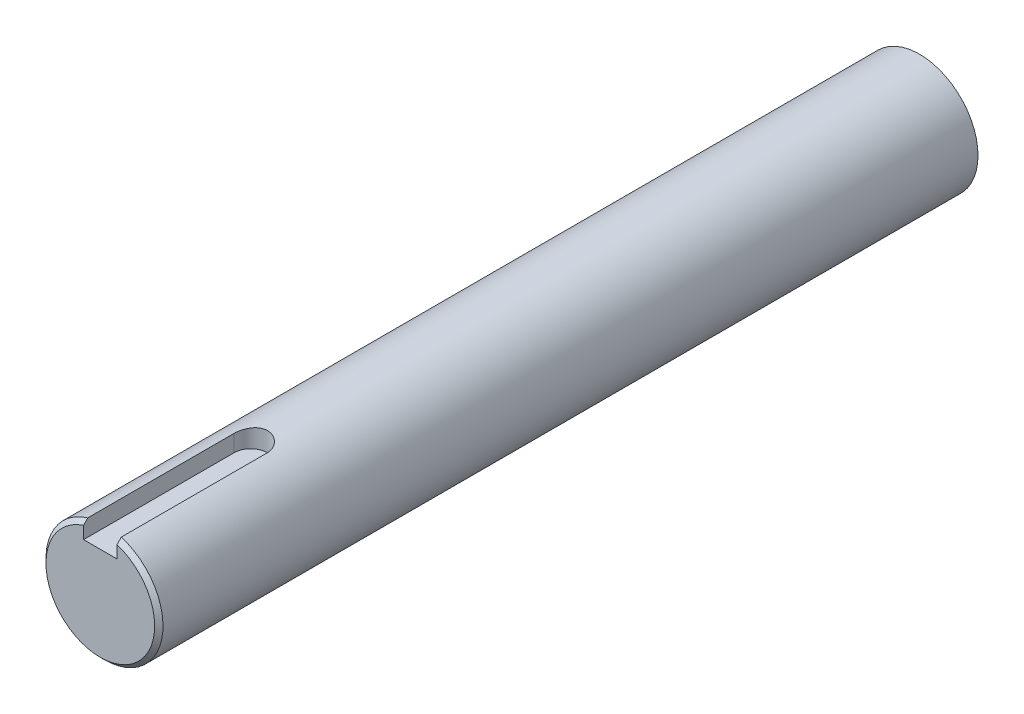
from build123d import *
from build123d.topology import SkipClean

# Parameters (mm, degrees)
EXTRUDE_1_DEPTH      = 98
SKETCH_2_R           = 7
EXTRUDE_4_DEPTH      = 80
CUT_EXTRUDE_20_DEPTH = 80
CHAMFER_1_SIZE       = 0.5


with BuildPart() as part:
    # Sketch 1 → Extrude 1 (new body)
    with BuildSketch(Plane.XY):
        with BuildLine():
            Line((2, 4.7), (-2, 4.7))
            Line((-2, 4.7), (-2, 6.708203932))
            ThreePointArc((-2, 6.708203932), (0, -7), (2, 6.708203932))
            Line((2, 6.708203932), (2, 4.7))
        make_face()
    extrude(amount=EXTRUDE_1_DEPTH)

    # Sketch 2 → Extrude 4 (add)
    with SkipClean():  # the faces are left unmerged after this step: merging them gives an invalid solid
        with BuildSketch(Plane(origin=(0, 0, 0), x_dir=(-1, 0, 0), z_dir=(0, 0, -1))):
            with Locations(Location((0, 0, 0), (0, 0, 73.398450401))):
                Circle(SKETCH_2_R)
        extrude(amount=-EXTRUDE_4_DEPTH)

    # Sketch 6 → Cut-Extrude 20 (cut)
    with SkipClean():  # the faces are left unmerged after this step: merging them gives an invalid solid
        with BuildSketch(Plane(origin=(0, 4.7, 0), x_dir=(1, 0, 0), z_dir=(0, 1, 0))):
            with BuildLine():
                Line((-2, -80), (2, -80))
                ThreePointArc((2, -80), (0, -78), (-2, -80))
            make_face()
        extrude(amount=CUT_EXTRUDE_20_DEPTH, mode=Mode.SUBTRACT)

    # Chamfer 1
    chamfer_1_edges = [part.edges().sort_by_distance(p)[0] for p in [
        (0, -7, 98),
    ]]
    chamfer(chamfer_1_edges, length=CHAMFER_1_SIZE)


solid = part.part
